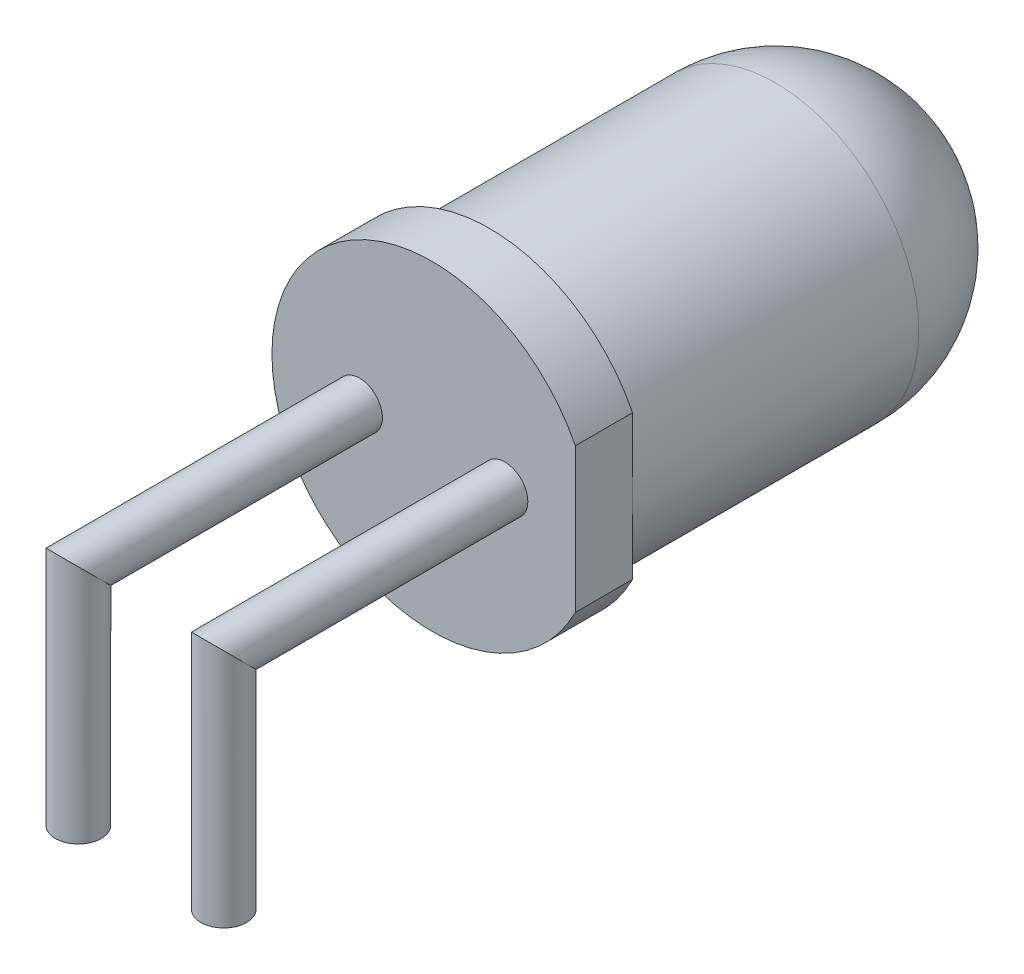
ISO-10303-21;
HEADER;
FILE_DESCRIPTION(('STEP AP214'),'2;1');
FILE_NAME('part.step','',(''),(''),'','','');
FILE_SCHEMA(('AUTOMOTIVE_DESIGN { 1 0 10303 214 1 1 1 1 }'));
ENDSEC;
DATA;
#1=APPLICATION_CONTEXT('core data for automotive mechanical design processes');
#2=APPLICATION_PROTOCOL_DEFINITION('international standard','automotive_design',2000,#1);
#3=PRODUCT_CONTEXT('',#1,'mechanical');
#4=PRODUCT('Part','Part','',(#3));
#5=PRODUCT_RELATED_PRODUCT_CATEGORY('part','',(#4));
#6=PRODUCT_DEFINITION_FORMATION('','',#4);
#7=PRODUCT_DEFINITION_CONTEXT('part definition',#1,'design');
#8=PRODUCT_DEFINITION('design','',#6,#7);
#9=PRODUCT_DEFINITION_SHAPE('','',#8);
#10=(LENGTH_UNIT() NAMED_UNIT(*) SI_UNIT(.MILLI.,.METRE.));
#11=(NAMED_UNIT(*) PLANE_ANGLE_UNIT() SI_UNIT($,.RADIAN.));
#12=(NAMED_UNIT(*) SI_UNIT($,.STERADIAN.) SOLID_ANGLE_UNIT());
#13=UNCERTAINTY_MEASURE_WITH_UNIT(LENGTH_MEASURE(1.E-05),#10,'distance_accuracy_value','');
#14=(GEOMETRIC_REPRESENTATION_CONTEXT(3) GLOBAL_UNCERTAINTY_ASSIGNED_CONTEXT((#13)) GLOBAL_UNIT_ASSIGNED_CONTEXT((#10,
#11,#12)) REPRESENTATION_CONTEXT('',''));
#15=CARTESIAN_POINT('',(0.,0.,0.));
#16=DIRECTION('',(0.,0.,1.));
#17=DIRECTION('',(1.,0.,0.));
#18=AXIS2_PLACEMENT_3D('',#15,#16,#17);
#19=CARTESIAN_POINT('',(0.,0.,8.5));
#20=DIRECTION('',(0.,0.,-1.));
#21=DIRECTION('',(-1.,0.,0.));
#22=AXIS2_PLACEMENT_3D('',#19,#20,#21);
#23=CYLINDRICAL_SURFACE('',#22,2.5);
#24=CARTESIAN_POINT('',(0.,0.,2.5));
#25=DIRECTION('',(0.,0.,-1.));
#26=DIRECTION('',(-1.,0.,0.));
#27=AXIS2_PLACEMENT_3D('',#24,#25,#26);
#28=CIRCLE('',#27,2.5);
#29=CARTESIAN_POINT('',(-2.5,0.,2.5));
#30=VERTEX_POINT('',#29);
#31=EDGE_CURVE('E31',#30,#30,#28,.F.);
#32=ORIENTED_EDGE('',*,*,#31,.T.);
#33=EDGE_LOOP('',(#32));
#34=FACE_BOUND('',#33,.T.);
#35=CARTESIAN_POINT('',(0.,0.,7.5));
#36=DIRECTION('',(0.,0.,1.));
#37=DIRECTION('',(1.,0.,0.));
#38=AXIS2_PLACEMENT_3D('',#35,#36,#37);
#39=CIRCLE('',#38,2.5);
#40=CARTESIAN_POINT('',(2.5,0.,7.5));
#41=VERTEX_POINT('',#40);
#42=EDGE_CURVE('E42',#41,#41,#39,.T.);
#43=ORIENTED_EDGE('',*,*,#42,.F.);
#44=EDGE_LOOP('',(#43));
#45=FACE_BOUND('',#44,.T.);
#46=ADVANCED_FACE('F28',(#34,#45),#23,.T.);
#47=CARTESIAN_POINT('',(0.,0.,7.5));
#48=DIRECTION('',(0.,0.,1.));
#49=DIRECTION('',(1.,0.,0.));
#50=AXIS2_PLACEMENT_3D('',#47,#48,#49);
#51=PLANE('',#50);
#52=DIRECTION('',(0.,1.,0.));
#53=VECTOR('',#52,1.);
#54=CARTESIAN_POINT('',(2.5,1.26095202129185,7.5));
#55=LINE('',#54,#53);
#56=CARTESIAN_POINT('',(2.5,1.26095202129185,7.5));
#57=VERTEX_POINT('',#56);
#58=EDGE_CURVE('E49',#41,#57,#55,.T.);
#59=ORIENTED_EDGE('',*,*,#58,.F.);
#60=ORIENTED_EDGE('',*,*,#42,.T.);
#61=CARTESIAN_POINT('',(2.5,-1.26095202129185,7.5));
#62=VERTEX_POINT('',#61);
#63=EDGE_CURVE('E71',#62,#41,#55,.T.);
#64=ORIENTED_EDGE('',*,*,#63,.F.);
#65=CARTESIAN_POINT('',(0.,0.,7.5));
#66=DIRECTION('',(0.,0.,1.));
#67=DIRECTION('',(1.,0.,0.));
#68=AXIS2_PLACEMENT_3D('',#65,#66,#67);
#69=CIRCLE('',#68,2.8);
#70=EDGE_CURVE('E67',#57,#62,#69,.T.);
#71=ORIENTED_EDGE('',*,*,#70,.F.);
#72=EDGE_LOOP('',(#59,#60,#64,#71));
#73=FACE_BOUND('',#72,.T.);
#74=ADVANCED_FACE('F117',(#73),#51,.F.);
#75=CARTESIAN_POINT('',(2.5,1.26095202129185,7.5));
#76=DIRECTION('',(1.,0.,0.));
#77=DIRECTION('',(0.,0.,-1.));
#78=AXIS2_PLACEMENT_3D('',#75,#76,#77);
#79=PLANE('',#78);
#80=ORIENTED_EDGE('',*,*,#63,.T.);
#81=ORIENTED_EDGE('',*,*,#58,.T.);
#82=DIRECTION('',(0.,0.,1.));
#83=VECTOR('',#82,1.);
#84=CARTESIAN_POINT('',(2.5,1.26095202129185,7.5));
#85=LINE('',#84,#83);
#86=CARTESIAN_POINT('',(2.5,1.26095202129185,8.5));
#87=VERTEX_POINT('',#86);
#88=EDGE_CURVE('E70',#57,#87,#85,.T.);
#89=ORIENTED_EDGE('',*,*,#88,.T.);
#90=DIRECTION('',(0.,1.,0.));
#91=VECTOR('',#90,1.);
#92=CARTESIAN_POINT('',(2.5,1.26095202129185,8.5));
#93=LINE('',#92,#91);
#94=CARTESIAN_POINT('',(2.5,-1.26095202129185,8.5));
#95=VERTEX_POINT('',#94);
#96=EDGE_CURVE('E75',#95,#87,#93,.T.);
#97=ORIENTED_EDGE('',*,*,#96,.F.);
#98=DIRECTION('',(0.,0.,1.));
#99=VECTOR('',#98,1.);
#100=CARTESIAN_POINT('',(2.5,-1.26095202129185,7.5));
#101=LINE('',#100,#99);
#102=EDGE_CURVE('E62',#62,#95,#101,.T.);
#103=ORIENTED_EDGE('',*,*,#102,.F.);
#104=EDGE_LOOP('',(#80,#81,#89,#97,#103));
#105=FACE_BOUND('',#104,.T.);
#106=ADVANCED_FACE('F78',(#105),#79,.T.);
#107=CARTESIAN_POINT('',(0.,0.,7.5));
#108=DIRECTION('',(0.,0.,1.));
#109=DIRECTION('',(1.,0.,0.));
#110=AXIS2_PLACEMENT_3D('',#107,#108,#109);
#111=CYLINDRICAL_SURFACE('',#110,2.8);
#112=CARTESIAN_POINT('',(0.,0.,8.5));
#113=DIRECTION('',(0.,0.,1.));
#114=DIRECTION('',(1.,0.,0.));
#115=AXIS2_PLACEMENT_3D('',#112,#113,#114);
#116=CIRCLE('',#115,2.8);
#117=EDGE_CURVE('E65',#87,#95,#116,.T.);
#118=ORIENTED_EDGE('',*,*,#117,.F.);
#119=ORIENTED_EDGE('',*,*,#88,.F.);
#120=ORIENTED_EDGE('',*,*,#70,.T.);
#121=ORIENTED_EDGE('',*,*,#102,.T.);
#122=EDGE_LOOP('',(#118,#119,#120,#121));
#123=FACE_BOUND('',#122,.T.);
#124=ADVANCED_FACE('F64',(#123),#111,.T.);
#125=CARTESIAN_POINT('',(0.,0.,8.5));
#126=DIRECTION('',(0.,0.,1.));
#127=DIRECTION('',(1.,0.,0.));
#128=AXIS2_PLACEMENT_3D('',#125,#126,#127);
#129=PLANE('',#128);
#130=CARTESIAN_POINT('',(1.27,0.,8.5));
#131=DIRECTION('',(0.,0.,1.));
#132=DIRECTION('',(1.,0.,0.));
#133=AXIS2_PLACEMENT_3D('',#130,#131,#132);
#134=CIRCLE('',#133,0.4);
#135=CARTESIAN_POINT('',(1.67,0.,8.5));
#136=VERTEX_POINT('',#135);
#137=EDGE_CURVE('E12',#136,#136,#134,.T.);
#138=ORIENTED_EDGE('',*,*,#137,.F.);
#139=EDGE_LOOP('',(#138));
#140=FACE_BOUND('',#139,.T.);
#141=CARTESIAN_POINT('',(-1.27,0.,8.5));
#142=DIRECTION('',(0.,0.,1.));
#143=DIRECTION('',(1.,0.,0.));
#144=AXIS2_PLACEMENT_3D('',#141,#142,#143);
#145=CIRCLE('',#144,0.4);
#146=CARTESIAN_POINT('',(-0.87,0.,8.5));
#147=VERTEX_POINT('',#146);
#148=EDGE_CURVE('E36',#147,#147,#145,.T.);
#149=ORIENTED_EDGE('',*,*,#148,.F.);
#150=EDGE_LOOP('',(#149));
#151=FACE_BOUND('',#150,.T.);
#152=ORIENTED_EDGE('',*,*,#96,.T.);
#153=ORIENTED_EDGE('',*,*,#117,.T.);
#154=EDGE_LOOP('',(#152,#153));
#155=FACE_BOUND('',#154,.T.);
#156=ADVANCED_FACE('F74',(#140,#151,#155),#129,.T.);
#157=CARTESIAN_POINT('',(0.,0.,2.5));
#158=DIRECTION('',(0.,0.,1.));
#159=DIRECTION('',(1.,0.,0.));
#160=AXIS2_PLACEMENT_3D('',#157,#158,#159);
#161=SPHERICAL_SURFACE('',#160,2.5);
#162=ORIENTED_EDGE('',*,*,#31,.F.);
#163=EDGE_LOOP('',(#162));
#164=FACE_BOUND('',#163,.T.);
#165=ADVANCED_FACE('F129',(#164),#161,.T.);
#166=CARTESIAN_POINT('',(-1.27,0.,13.4116370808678));
#167=DIRECTION('',(0.,-1.,0.));
#168=DIRECTION('',(0.,0.,-1.));
#169=AXIS2_PLACEMENT_3D('',#166,#167,#168);
#170=CYLINDRICAL_SURFACE('',#169,0.4);
#171=CARTESIAN_POINT('',(-1.27,0.,13.4116370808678));
#172=DIRECTION('',(0.,-0.707106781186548,0.707106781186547));
#173=DIRECTION('',(0.,-0.707106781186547,-0.707106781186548));
#174=AXIS2_PLACEMENT_3D('',#171,#172,#173);
#175=ELLIPSE('',#174,0.565685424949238,0.4);
#176=CARTESIAN_POINT('',(-1.27,-0.400000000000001,13.0116370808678));
#177=VERTEX_POINT('',#176);
#178=EDGE_CURVE('E96',#177,#177,#175,.T.);
#179=ORIENTED_EDGE('',*,*,#178,.T.);
#180=EDGE_LOOP('',(#179));
#181=FACE_BOUND('',#180,.T.);
#182=CARTESIAN_POINT('',(-1.27,-3.91163708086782,13.4116370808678));
#183=DIRECTION('',(0.,-1.,0.));
#184=DIRECTION('',(0.,0.,-1.));
#185=AXIS2_PLACEMENT_3D('',#182,#183,#184);
#186=CIRCLE('',#185,0.4);
#187=CARTESIAN_POINT('',(-1.27,-3.91163708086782,13.0116370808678));
#188=VERTEX_POINT('',#187);
#189=EDGE_CURVE('E76',#188,#188,#186,.F.);
#190=ORIENTED_EDGE('',*,*,#189,.T.);
#191=EDGE_LOOP('',(#190));
#192=FACE_BOUND('',#191,.T.);
#193=ADVANCED_FACE('F101',(#181,#192),#170,.T.);
#194=CARTESIAN_POINT('',(-1.27,0.,14.5430079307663));
#195=DIRECTION('',(0.,0.,-1.));
#196=DIRECTION('',(0.,1.,0.));
#197=AXIS2_PLACEMENT_3D('',#194,#195,#196);
#198=CYLINDRICAL_SURFACE('',#197,0.4);
#199=ORIENTED_EDGE('',*,*,#148,.T.);
#200=EDGE_LOOP('',(#199));
#201=FACE_BOUND('',#200,.T.);
#202=ORIENTED_EDGE('',*,*,#178,.F.);
#203=EDGE_LOOP('',(#202));
#204=FACE_BOUND('',#203,.T.);
#205=ADVANCED_FACE('F106',(#201,#204),#198,.T.);
#206=CARTESIAN_POINT('',(-1.27,-3.91163708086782,13.4116370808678));
#207=DIRECTION('',(0.,-1.,0.));
#208=DIRECTION('',(0.,0.,-1.));
#209=AXIS2_PLACEMENT_3D('',#206,#207,#208);
#210=PLANE('',#209);
#211=ORIENTED_EDGE('',*,*,#189,.F.);
#212=EDGE_LOOP('',(#211));
#213=FACE_BOUND('',#212,.T.);
#214=ADVANCED_FACE('F103',(#213),#210,.T.);
#215=CARTESIAN_POINT('',(1.27,0.,13.4116370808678));
#216=DIRECTION('',(0.,-1.,0.));
#217=DIRECTION('',(0.,0.,-1.));
#218=AXIS2_PLACEMENT_3D('',#215,#216,#217);
#219=CYLINDRICAL_SURFACE('',#218,0.4);
#220=CARTESIAN_POINT('',(1.27,0.,13.4116370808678));
#221=DIRECTION('',(0.,-0.707106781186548,0.707106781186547));
#222=DIRECTION('',(0.,-0.707106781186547,-0.707106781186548));
#223=AXIS2_PLACEMENT_3D('',#220,#221,#222);
#224=ELLIPSE('',#223,0.565685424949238,0.4);
#225=CARTESIAN_POINT('',(1.27,-0.4,13.0116370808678));
#226=VERTEX_POINT('',#225);
#227=EDGE_CURVE('E147',#226,#226,#224,.T.);
#228=ORIENTED_EDGE('',*,*,#227,.T.);
#229=EDGE_LOOP('',(#228));
#230=FACE_BOUND('',#229,.T.);
#231=CARTESIAN_POINT('',(1.27,-3.91163708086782,13.4116370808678));
#232=DIRECTION('',(0.,-1.,0.));
#233=DIRECTION('',(0.,0.,-1.));
#234=AXIS2_PLACEMENT_3D('',#231,#232,#233);
#235=CIRCLE('',#234,0.4);
#236=CARTESIAN_POINT('',(1.27,-3.91163708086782,13.0116370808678));
#237=VERTEX_POINT('',#236);
#238=EDGE_CURVE('E94',#237,#237,#235,.F.);
#239=ORIENTED_EDGE('',*,*,#238,.T.);
#240=EDGE_LOOP('',(#239));
#241=FACE_BOUND('',#240,.T.);
#242=ADVANCED_FACE('F105',(#230,#241),#219,.T.);
#243=CARTESIAN_POINT('',(1.27,0.,14.5430079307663));
#244=DIRECTION('',(0.,0.,-1.));
#245=DIRECTION('',(0.,1.,0.));
#246=AXIS2_PLACEMENT_3D('',#243,#244,#245);
#247=CYLINDRICAL_SURFACE('',#246,0.4);
#248=ORIENTED_EDGE('',*,*,#137,.T.);
#249=EDGE_LOOP('',(#248));
#250=FACE_BOUND('',#249,.T.);
#251=ORIENTED_EDGE('',*,*,#227,.F.);
#252=EDGE_LOOP('',(#251));
#253=FACE_BOUND('',#252,.T.);
#254=ADVANCED_FACE('F112',(#250,#253),#247,.T.);
#255=CARTESIAN_POINT('',(1.27,-3.91163708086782,13.4116370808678));
#256=DIRECTION('',(0.,-1.,0.));
#257=DIRECTION('',(0.,0.,-1.));
#258=AXIS2_PLACEMENT_3D('',#255,#256,#257);
#259=PLANE('',#258);
#260=ORIENTED_EDGE('',*,*,#238,.F.);
#261=EDGE_LOOP('',(#260));
#262=FACE_BOUND('',#261,.T.);
#263=ADVANCED_FACE('F143',(#262),#259,.T.);
#264=CLOSED_SHELL('',(#46,#74,#106,#124,#156,#165,#193,#205,#214,#242,#254,#263));
#265=MANIFOLD_SOLID_BREP('B2',#264);
#266=ADVANCED_BREP_SHAPE_REPRESENTATION('',(#18,#265),#14);
#267=SHAPE_DEFINITION_REPRESENTATION(#9,#266);
ENDSEC;
END-ISO-10303-21;
